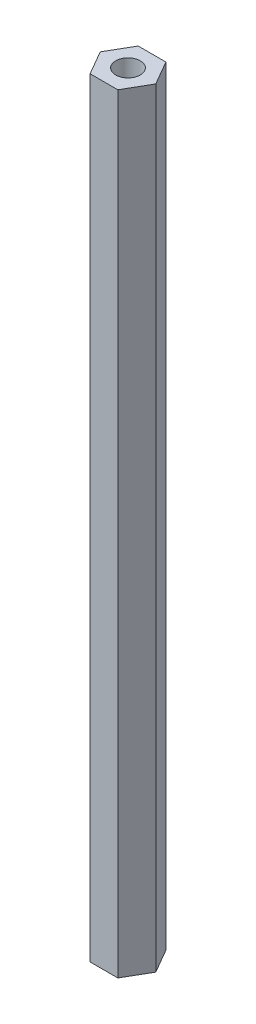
from build123d import *

# Parameters (mm, degrees)
SKETCH1_R           = 1.6256
BOSS_EXTRUDE1_DEPTH = 101.6


with BuildPart() as part:
    # Sketch1 → Boss-Extrude1 (new body)
    with BuildSketch(Plane(origin=(0, 0, 0), x_dir=(1, 0, 0), z_dir=(0, 1, 0))):
        Polygon((1.833087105, 3.175), (-1.833087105, 3.175), (-3.666174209, 0), (-1.833087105, -3.175), (1.833087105, -3.175), (3.666174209, 0), align=None)
        with Locations(Location((0, 0, 0), (0, 0, 270))):
            Circle(SKETCH1_R, mode=Mode.SUBTRACT)
    extrude(amount=BOSS_EXTRUDE1_DEPTH)


solid = part.part
